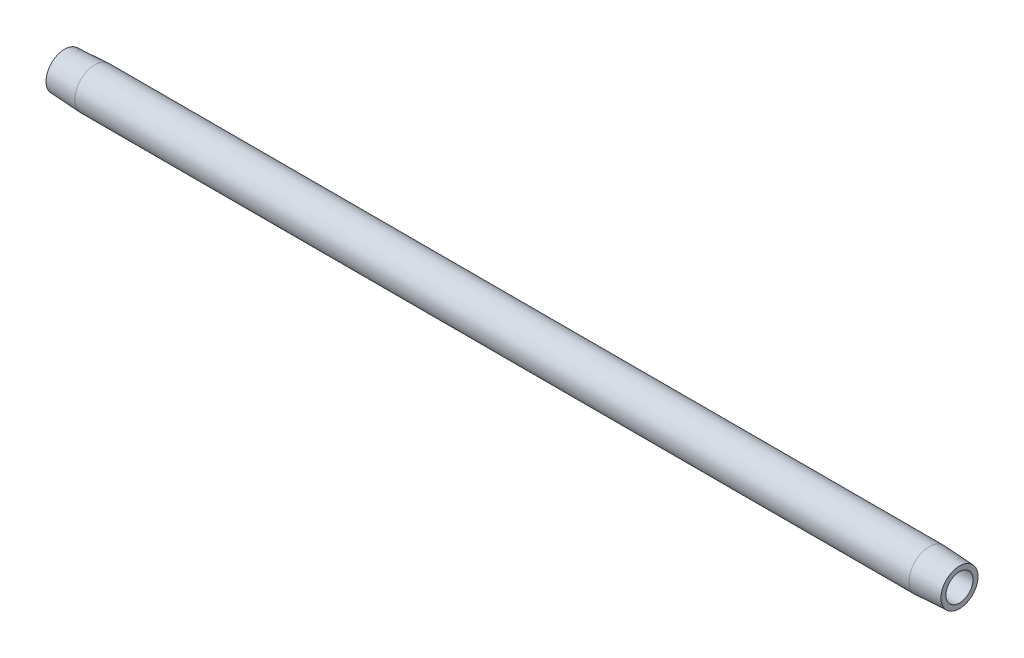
ISO-10303-21;
HEADER;
FILE_DESCRIPTION(('STEP AP214'),'2;1');
FILE_NAME('part.step','',(''),(''),'','','');
FILE_SCHEMA(('AUTOMOTIVE_DESIGN { 1 0 10303 214 1 1 1 1 }'));
ENDSEC;
DATA;
#1=APPLICATION_CONTEXT('core data for automotive mechanical design processes');
#2=APPLICATION_PROTOCOL_DEFINITION('international standard','automotive_design',2000,#1);
#3=PRODUCT_CONTEXT('',#1,'mechanical');
#4=PRODUCT('Part','Part','',(#3));
#5=PRODUCT_RELATED_PRODUCT_CATEGORY('part','',(#4));
#6=PRODUCT_DEFINITION_FORMATION('','',#4);
#7=PRODUCT_DEFINITION_CONTEXT('part definition',#1,'design');
#8=PRODUCT_DEFINITION('design','',#6,#7);
#9=PRODUCT_DEFINITION_SHAPE('','',#8);
#10=(LENGTH_UNIT() NAMED_UNIT(*) SI_UNIT(.MILLI.,.METRE.));
#11=(NAMED_UNIT(*) PLANE_ANGLE_UNIT() SI_UNIT($,.RADIAN.));
#12=(NAMED_UNIT(*) SI_UNIT($,.STERADIAN.) SOLID_ANGLE_UNIT());
#13=UNCERTAINTY_MEASURE_WITH_UNIT(LENGTH_MEASURE(1.E-05),#10,'distance_accuracy_value','');
#14=(GEOMETRIC_REPRESENTATION_CONTEXT(3) GLOBAL_UNCERTAINTY_ASSIGNED_CONTEXT((#13)) GLOBAL_UNIT_ASSIGNED_CONTEXT((#10,
#11,#12)) REPRESENTATION_CONTEXT('',''));
#15=CARTESIAN_POINT('',(0.,0.,0.));
#16=DIRECTION('',(0.,0.,1.));
#17=DIRECTION('',(1.,0.,0.));
#18=AXIS2_PLACEMENT_3D('',#15,#16,#17);
#19=CARTESIAN_POINT('',(304.8,0.,-4.62277681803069));
#20=DIRECTION('',(-1.,0.,0.));
#21=DIRECTION('',(0.,0.,1.));
#22=AXIS2_PLACEMENT_3D('',#19,#20,#21);
#23=PLANE('',#22);
#24=CARTESIAN_POINT('',(304.8,0.,0.));
#25=DIRECTION('',(-1.,0.,0.));
#26=DIRECTION('',(0.,0.,1.));
#27=AXIS2_PLACEMENT_3D('',#24,#25,#26);
#28=CIRCLE('',#27,6.31752683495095);
#29=CARTESIAN_POINT('',(304.8,0.,6.31752683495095));
#30=VERTEX_POINT('',#29);
#31=EDGE_CURVE('E10',#30,#30,#28,.T.);
#32=ORIENTED_EDGE('',*,*,#31,.F.);
#33=EDGE_LOOP('',(#32));
#34=FACE_BOUND('',#33,.T.);
#35=CARTESIAN_POINT('',(304.8,0.,0.));
#36=DIRECTION('',(-1.,0.,0.));
#37=DIRECTION('',(0.,0.,1.));
#38=AXIS2_PLACEMENT_3D('',#35,#36,#37);
#39=CIRCLE('',#38,4.62277681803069);
#40=CARTESIAN_POINT('',(304.8,0.,4.62277681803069));
#41=VERTEX_POINT('',#40);
#42=EDGE_CURVE('E52',#41,#41,#39,.T.);
#43=ORIENTED_EDGE('',*,*,#42,.T.);
#44=EDGE_LOOP('',(#43));
#45=FACE_BOUND('',#44,.T.);
#46=ADVANCED_FACE('F30',(#34,#45),#23,.F.);
#47=CARTESIAN_POINT('',(304.8,0.,0.));
#48=DIRECTION('',(-1.,0.,0.));
#49=DIRECTION('',(0.,0.,1.));
#50=AXIS2_PLACEMENT_3D('',#47,#48,#49);
#51=CONICAL_SURFACE('',#50,6.31752683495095,0.052359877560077);
#52=CARTESIAN_POINT('',(294.487600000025,0.,0.));
#53=DIRECTION('',(-1.,0.,0.));
#54=DIRECTION('',(0.,0.,1.));
#55=AXIS2_PLACEMENT_3D('',#52,#53,#54);
#56=CIRCLE('',#55,6.85797681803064);
#57=CARTESIAN_POINT('',(294.487600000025,0.,6.85797681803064));
#58=VERTEX_POINT('',#57);
#59=EDGE_CURVE('E36',#58,#58,#56,.T.);
#60=ORIENTED_EDGE('',*,*,#59,.F.);
#61=EDGE_LOOP('',(#60));
#62=FACE_BOUND('',#61,.T.);
#63=ORIENTED_EDGE('',*,*,#31,.T.);
#64=EDGE_LOOP('',(#63));
#65=FACE_BOUND('',#64,.T.);
#66=ADVANCED_FACE('F77',(#62,#65),#51,.T.);
#67=CARTESIAN_POINT('',(-6.37599469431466,0.,0.));
#68=DIRECTION('',(-1.,0.,0.));
#69=DIRECTION('',(0.,0.,1.));
#70=AXIS2_PLACEMENT_3D('',#67,#68,#69);
#71=CYLINDRICAL_SURFACE('',#70,6.85797681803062);
#72=CARTESIAN_POINT('',(10.3123999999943,0.,0.));
#73=DIRECTION('',(-1.,0.,0.));
#74=DIRECTION('',(0.,0.,1.));
#75=AXIS2_PLACEMENT_3D('',#72,#73,#74);
#76=CIRCLE('',#75,6.8579768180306);
#77=CARTESIAN_POINT('',(10.3123999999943,0.,6.8579768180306));
#78=VERTEX_POINT('',#77);
#79=EDGE_CURVE('E40',#78,#78,#76,.T.);
#80=ORIENTED_EDGE('',*,*,#79,.F.);
#81=EDGE_LOOP('',(#80));
#82=FACE_BOUND('',#81,.T.);
#83=ORIENTED_EDGE('',*,*,#59,.T.);
#84=EDGE_LOOP('',(#83));
#85=FACE_BOUND('',#84,.T.);
#86=ADVANCED_FACE('F72',(#82,#85),#71,.T.);
#87=CARTESIAN_POINT('',(10.3123999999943,0.,0.));
#88=DIRECTION('',(1.,0.,0.));
#89=DIRECTION('',(0.,0.,-1.));
#90=AXIS2_PLACEMENT_3D('',#87,#88,#89);
#91=CONICAL_SURFACE('',#90,6.8579768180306,0.0523598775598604);
#92=CARTESIAN_POINT('',(1.90819582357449E-11,0.,0.));
#93=DIRECTION('',(-1.,0.,0.));
#94=DIRECTION('',(0.,0.,1.));
#95=AXIS2_PLACEMENT_3D('',#92,#93,#94);
#96=CIRCLE('',#95,6.31752683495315);
#97=CARTESIAN_POINT('',(1.90819582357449E-11,0.,6.31752683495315));
#98=VERTEX_POINT('',#97);
#99=EDGE_CURVE('E44',#98,#98,#96,.T.);
#100=ORIENTED_EDGE('',*,*,#99,.F.);
#101=EDGE_LOOP('',(#100));
#102=FACE_BOUND('',#101,.T.);
#103=ORIENTED_EDGE('',*,*,#79,.T.);
#104=EDGE_LOOP('',(#103));
#105=FACE_BOUND('',#104,.T.);
#106=ADVANCED_FACE('F66',(#102,#105),#91,.T.);
#107=CARTESIAN_POINT('',(1.90819582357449E-11,0.,-6.31752683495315));
#108=DIRECTION('',(1.,0.,0.));
#109=DIRECTION('',(0.,0.,-1.));
#110=AXIS2_PLACEMENT_3D('',#107,#108,#109);
#111=PLANE('',#110);
#112=CARTESIAN_POINT('',(1.90819582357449E-11,0.,0.));
#113=DIRECTION('',(-1.,0.,0.));
#114=DIRECTION('',(0.,0.,1.));
#115=AXIS2_PLACEMENT_3D('',#112,#113,#114);
#116=CIRCLE('',#115,4.62277681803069);
#117=CARTESIAN_POINT('',(1.90819582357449E-11,0.,4.62277681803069));
#118=VERTEX_POINT('',#117);
#119=EDGE_CURVE('E49',#118,#118,#116,.T.);
#120=ORIENTED_EDGE('',*,*,#119,.F.);
#121=EDGE_LOOP('',(#120));
#122=FACE_BOUND('',#121,.T.);
#123=ORIENTED_EDGE('',*,*,#99,.T.);
#124=EDGE_LOOP('',(#123));
#125=FACE_BOUND('',#124,.T.);
#126=ADVANCED_FACE('F60',(#122,#125),#111,.F.);
#127=CARTESIAN_POINT('',(-6.37599469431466,0.,0.));
#128=DIRECTION('',(-1.,0.,0.));
#129=DIRECTION('',(0.,0.,1.));
#130=AXIS2_PLACEMENT_3D('',#127,#128,#129);
#131=CYLINDRICAL_SURFACE('',#130,4.62277681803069);
#132=ORIENTED_EDGE('',*,*,#42,.F.);
#133=EDGE_LOOP('',(#132));
#134=FACE_BOUND('',#133,.T.);
#135=ORIENTED_EDGE('',*,*,#119,.T.);
#136=EDGE_LOOP('',(#135));
#137=FACE_BOUND('',#136,.T.);
#138=ADVANCED_FACE('F57',(#134,#137),#131,.F.);
#139=CLOSED_SHELL('',(#46,#66,#86,#106,#126,#138));
#140=MANIFOLD_SOLID_BREP('B2',#139);
#141=ADVANCED_BREP_SHAPE_REPRESENTATION('',(#18,#140),#14);
#142=SHAPE_DEFINITION_REPRESENTATION(#9,#141);
ENDSEC;
END-ISO-10303-21;
